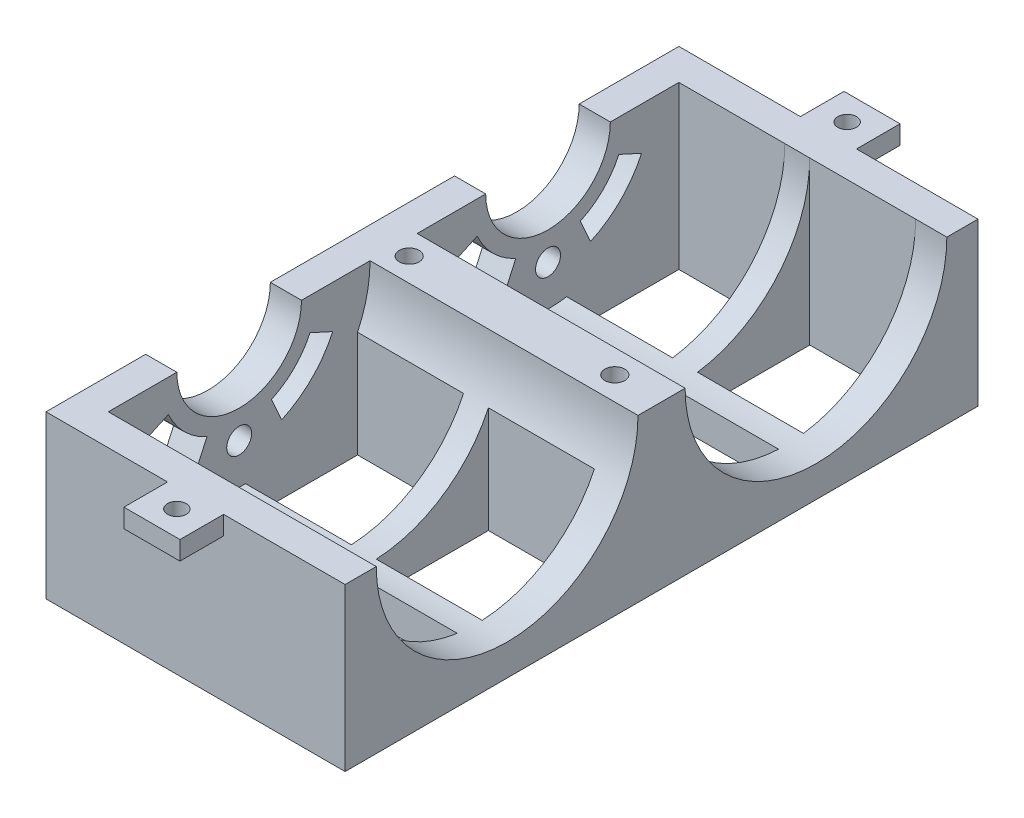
from build123d import *

# Parameters (mm, degrees)
SKETCH_1_W          = 48
SKETCH_1_H          = 52
EXTRUDE_1_DEPTH     = 26
CUT_EXTRUDE_1_DEPTH = 43
SKETCH_3_R          = 10
CUT_EXTRUDE_2_DEPTH = 72.220307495
SKETCH_3_3_R        = 2
CUT_EXTRUDE_3_DEPTH = 72.220307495
SKETCH_4_W          = 9
SKETCH_4_H          = 7
SKETCH_4_R          = 1.5
EXTRUDE_2_DEPTH     = 3
SKETCH_5_R          = 2
EXTRUDE_3_DEPTH     = 5
EXTRUDE_4_DEPTH     = 48
SKETCH_6_W          = 9
SKETCH_6_H          = 7
SKETCH_6_R          = 1.5
EXTRUDE_5_DEPTH     = 3
SKETCH_7_R          = 1.6
CUT_EXTRUDE_4_DEPTH = 26
SKETCH_8_W          = 17
SKETCH_8_H          = 18
CUT_EXTRUDE_5_DEPTH = 110.083374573


with BuildPart() as part:
    # Sketch 1 → Extrude 1 (new body)
    with BuildSketch(Plane(origin=(0, 0, 0), x_dir=(1, 0, 0), z_dir=(0, 1, 0))):
        with Locations((-3.522349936, -19.74201788)):
            Rectangle(SKETCH_1_W, SKETCH_1_H)
    extrude(amount=EXTRUDE_1_DEPTH)

    # Sketch 2 → Cut-Extrude 1 (cut)
    with BuildSketch(Plane(origin=(20.477650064, 0, 0), x_dir=(0, 0, -1), z_dir=(1, 0, 0))):
        with BuildLine():
            Line((1.25798212, 26), (-19.74201788, 26))
            Line((-19.74201788, 26), (-19.74201788, 5))
            ThreePointArc((-19.74201788, 5), (-4.892775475, 11.150757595), (1.25798212, 26))
        make_face()
        with BuildLine():
            Line((-40.74201788, 26), (-19.74201788, 26))
            Line((-19.74201788, 26), (1.25798212, 26))
            ThreePointArc((1.25798212, 26), (-19.74201788, 47), (-40.74201788, 26))
        make_face()
        with BuildLine():
            Line((-19.74201788, 5), (-19.74201788, 26))
            Line((-19.74201788, 26), (-40.74201788, 26))
            ThreePointArc((-40.74201788, 26), (-34.591260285, 11.150757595), (-19.74201788, 5))
        make_face()
        with BuildLine():
            Line((1.25798212, 26), (-19.74201788, 26))
            Line((-19.74201788, 26), (-19.74201788, 5))
            ThreePointArc((-19.74201788, 5), (-4.892775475, 11.150757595), (1.25798212, 26))
        make_face()
        with BuildLine():
            Line((-40.74201788, 26), (-19.74201788, 26))
            Line((-19.74201788, 26), (1.25798212, 26))
            ThreePointArc((1.25798212, 26), (-19.74201788, 47), (-40.74201788, 26))
        make_face()
        with BuildLine():
            Line((-19.74201788, 5), (-19.74201788, 26))
            Line((-19.74201788, 26), (-40.74201788, 26))
            ThreePointArc((-40.74201788, 26), (-34.591260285, 11.150757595), (-19.74201788, 5))
        make_face()
    extrude(amount=-CUT_EXTRUDE_1_DEPTH, mode=Mode.SUBTRACT)

    # Sketch 3 → Cut-Extrude 2 (cut, through all)
    with BuildSketch(Plane.ZY.offset(27.522349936)):
        with Locations((19.74201788, 26)):
            Circle(SKETCH_3_R)
    extrude(amount=-CUT_EXTRUDE_2_DEPTH, mode=Mode.SUBTRACT)

    # Sketch 3_3 → Cut-Extrude 3 (cut, through all)
    with BuildSketch(Plane.ZY.offset(27.522349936)):
        with BuildLine():
            ThreePointArc((14.569604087, 14.620363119), (10.911928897, 17.152428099), (8.372634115, 20.805087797))
            Line((8.372634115, 20.805087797), (4.73443131, 19.142715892))
            ThreePointArc((4.73443131, 19.142715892), (8.086300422, 14.32120509), (12.914431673, 10.978879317))
            Line((12.914431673, 10.978879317), (14.569604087, 14.620363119))
        make_face()
        with BuildLine():
            ThreePointArc((31.111401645, 20.805087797), (28.572106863, 17.152428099), (24.914431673, 14.620363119))
            Line((24.914431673, 14.620363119), (26.569604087, 10.978879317))
            ThreePointArc((26.569604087, 10.978879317), (31.397735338, 14.32120509), (34.74960445, 19.142715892))
            Line((34.74960445, 19.142715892), (31.111401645, 20.805087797))
        make_face()
        with Locations((19.74201788, 11.5)):
            Circle(SKETCH_3_3_R)
    extrude(amount=-CUT_EXTRUDE_3_DEPTH, mode=Mode.SUBTRACT)

    # Sketch 4 → Extrude 2 (add)
    # profile 1 of 3: a face of its own
    with BuildSketch(Plane(origin=(0, 26, 0), x_dir=(1, 0, 0), z_dir=(0, 1, 0))):
        with Locations((-3.522349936, 9.75798212)):
            Rectangle(SKETCH_4_W, SKETCH_4_H)
        with Locations(Location((-3.522349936, 9.25798212, 0), (0, 0, 270))):
            Circle(SKETCH_4_R, mode=Mode.SUBTRACT)
    # profile 2 of 3: a face of its own
    with BuildSketch(Plane(origin=(0, 26, 0), x_dir=(1, 0, 0), z_dir=(0, 1, 0))):
        Polygon((-22.522349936, -29.74201788), (-27.522349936, -29.74201788), (-27.522349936, -45.74201788), (20.477650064, -45.74201788), (20.477650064, -40.74201788), (-22.522349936, -40.74201788), align=None)
    # profile 3 of 3: a face of its own
    with BuildSketch(Plane(origin=(0, 26, 0), x_dir=(1, 0, 0), z_dir=(0, 1, 0))):
        Polygon((-27.522349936, -9.74201788), (-22.522349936, -9.74201788), (-22.522349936, 1.25798212), (20.477650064, 1.25798212), (20.477650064, 6.25798212), (-27.522349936, 6.25798212), align=None)
    extrude(amount=-EXTRUDE_2_DEPTH)

    # Sketch 5 → Extrude 3 (add)
    with BuildSketch(Plane.ZY.offset(27.522349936)):
        with BuildLine():
            ThreePointArc((79.30201788, 26), (69.30201788, 16), (59.30201788, 26))
            Line((59.30201788, 26), (45.74201788, 26))
            Line((45.74201788, 26), (45.74201788, 0))
            Line((45.74201788, 0), (95.30201788, 0))
            Line((95.30201788, 0), (95.30201788, 26))
            Line((95.30201788, 26), (79.30201788, 26))
        make_face()
        with Locations((69.30201788, 11.5)):
            Circle(SKETCH_5_R, mode=Mode.SUBTRACT)
        with BuildLine():
            ThreePointArc((74.474431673, 14.620363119), (78.132106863, 17.152428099), (80.671401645, 20.805087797))
            Line((80.671401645, 20.805087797), (84.30960445, 19.142715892))
            ThreePointArc((84.30960445, 19.142715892), (80.957735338, 14.32120509), (76.129604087, 10.978879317))
            Line((76.129604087, 10.978879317), (74.474431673, 14.620363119))
        make_face(mode=Mode.SUBTRACT)
        with BuildLine():
            ThreePointArc((57.932634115, 20.805087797), (60.471928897, 17.152428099), (64.129604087, 14.620363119))
            Line((64.129604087, 14.620363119), (62.474431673, 10.978879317))
            ThreePointArc((62.474431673, 10.978879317), (57.646300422, 14.32120509), (54.29443131, 19.142715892))
            Line((54.29443131, 19.142715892), (57.932634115, 20.805087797))
        make_face(mode=Mode.SUBTRACT)
    extrude(amount=-EXTRUDE_3_DEPTH)

    # Sketch 5_3 → Extrude 4 (add)
    with BuildSketch(Plane.ZY.offset(27.522349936)):
        with BuildLine():
            Line((48.30201788, 26), (45.74201788, 26))
            Line((45.74201788, 26), (45.74201788, 0))
            Line((45.74201788, 0), (95.30201788, 0))
            Line((95.30201788, 0), (95.30201788, 26))
            Line((95.30201788, 26), (90.30201788, 26))
            ThreePointArc((90.30201788, 26), (69.30201788, 5), (48.30201788, 26))
        make_face()
    extrude(amount=-EXTRUDE_4_DEPTH)

    # Sketch 6 → Extrude 5 (add)
    with BuildSketch(Plane(origin=(0, 26, 0), x_dir=(1, 0, 0), z_dir=(0, 1, 0))):
        with Locations((-3.522349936, -98.80201788)):
            Rectangle(SKETCH_6_W, SKETCH_6_H)
        with Locations(Location((-3.522349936, -98.30201788, 0), (0, 0, 270))):
            Circle(SKETCH_6_R, mode=Mode.SUBTRACT)
    extrude(amount=-EXTRUDE_5_DEPTH)

    # Sketch 7 → Cut-Extrude 4 (cut)
    with BuildSketch(Plane(origin=(0, 26, 0), x_dir=(1, 0, 0), z_dir=(0, 1, 0))):
        with Locations(Location((-20.022349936, -44.52201788, 0), (0, 0, 270))):
            Circle(SKETCH_7_R)
        with Locations(Location((12.977650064, -44.52201788, 0), (0, 0, 270))):
            Circle(SKETCH_7_R)
    extrude(amount=-CUT_EXTRUDE_4_DEPTH, mode=Mode.SUBTRACT)

    # Sketch 8 → Cut-Extrude 5 (cut, through all)
    with BuildSketch(Plane.XZ):
        with Locations((-14.022349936, 81.30201788)):
            Rectangle(SKETCH_8_W, SKETCH_8_H)
        with Locations((6.977650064, 81.30201788)):
            Rectangle(SKETCH_8_W, SKETCH_8_H)
        with Locations((6.977650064, 59.30201788)):
            Rectangle(SKETCH_8_W, SKETCH_8_H)
        with Locations((-14.022349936, 59.30201788)):
            Rectangle(SKETCH_8_W, SKETCH_8_H)
        with Locations((6.977650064, 29.74201788)):
            Rectangle(SKETCH_8_W, SKETCH_8_H)
        with Locations((-14.022349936, 29.74201788)):
            Rectangle(SKETCH_8_W, SKETCH_8_H)
        with Locations((6.977650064, 7.74201788)):
            Rectangle(SKETCH_8_W, SKETCH_8_H)
        with Locations((-14.022349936, 7.74201788)):
            Rectangle(SKETCH_8_W, SKETCH_8_H)
    extrude(amount=-CUT_EXTRUDE_5_DEPTH, mode=Mode.SUBTRACT)


solid = part.part
